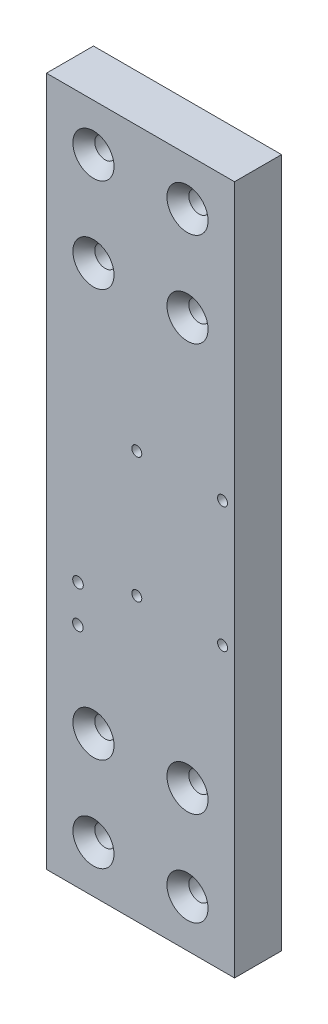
from build123d import *

# Parameters (mm, degrees)
SKETCH1_W                                            = 76.2
SKETCH1_H                                            = 279.4
EXTRUDE1_DEPTH                                       = 19.05
CSK_FOR_5_16_FLAT_HEAD_SOCKET_CAP_SCREW1_D           = 8.4328
CSK_FOR_5_16_FLAT_HEAD_SOCKET_CAP_SCREW1_CSINK_D     = 16.6624
CSK_FOR_5_16_FLAT_HEAD_SOCKET_CAP_SCREW1_CSINK_ANGLE = 82
LPATTERN1_COUNT                                      = 2
LPATTERN1_PITCH                                      = 38.1
LPATTERN1_COUNT_DIR2                                 = 2
LPATTERN1_PITCH_DIR2                                 = 38.1
MIRROR1_COPY_1_D                                     = 8.4328
MIRROR1_COPY_1_CSINK_D                               = 16.6624
MIRROR1_COPY_1_CSINK_ANGLE                           = 82
MIRROR1_COPY_2_D                                     = 8.4328
MIRROR1_COPY_2_CSINK_D                               = 16.6624
MIRROR1_COPY_2_CSINK_ANGLE                           = 82
MIRROR1_COPY_3_D                                     = 8.4328
MIRROR1_COPY_3_CSINK_D                               = 16.6624
MIRROR1_COPY_3_CSINK_ANGLE                           = 82
F_10_32_TAPPED_HOLE1_D                               = 4.0386
F_6_CLEARANCE_HOLE1_D                                = 4.3053


with BuildPart() as part:
    # Sketch1 → Extrude1 (new body)
    with BuildSketch(Plane.XY):
        Rectangle(SKETCH1_W, SKETCH1_H)
    extrude(amount=EXTRUDE1_DEPTH)

    # CSK for 5_16 Flat Head Socket Cap Screw1 (through all)
    with Locations(Plane(origin=(-19.05, -120.65, 19.05), x_dir=(1, 0, 0), z_dir=(0, 0, 1))):
        with Locations((0, 0)):
            csk_for_5_16_flat_head_socket_cap_screw1 = CounterSinkHole(CSK_FOR_5_16_FLAT_HEAD_SOCKET_CAP_SCREW1_D / 2, CSK_FOR_5_16_FLAT_HEAD_SOCKET_CAP_SCREW1_CSINK_D / 2, counter_sink_angle=CSK_FOR_5_16_FLAT_HEAD_SOCKET_CAP_SCREW1_CSINK_ANGLE)

    # LPattern1: CSK for 5_16 Flat Head Socket Cap Screw1 2 × 2
    with Locations(*[(j * LPATTERN1_PITCH_DIR2, i * LPATTERN1_PITCH, 0) for i in range(LPATTERN1_COUNT) for j in range(LPATTERN1_COUNT_DIR2) if (i, j) != (0, 0)]):
        add(csk_for_5_16_flat_head_socket_cap_screw1, mode=Mode.SUBTRACT)

    # Mirror1: CSK for 5_16 Flat Head Socket Cap Screw1 across plane
    add(csk_for_5_16_flat_head_socket_cap_screw1.mirror(Plane.ZX), mode=Mode.SUBTRACT)

    # Mirror1 copy 1 (through all)
    with Locations(Plane(origin=(19.05, 120.65, 19.05), x_dir=(1, 0, 0), z_dir=(0, 0, 1))):
        with Locations((0, 0)):
            CounterSinkHole(MIRROR1_COPY_1_D / 2, MIRROR1_COPY_1_CSINK_D / 2, counter_sink_angle=MIRROR1_COPY_1_CSINK_ANGLE)

    # Mirror1 copy 2 (through all)
    with Locations(Plane(origin=(-19.05, 82.55, 19.05), x_dir=(1, 0, 0), z_dir=(0, 0, 1))):
        with Locations((0, 0)):
            CounterSinkHole(MIRROR1_COPY_2_D / 2, MIRROR1_COPY_2_CSINK_D / 2, counter_sink_angle=MIRROR1_COPY_2_CSINK_ANGLE)

    # Mirror1 copy 3 (through all)
    with Locations(Plane(origin=(19.05, 82.55, 19.05), x_dir=(1, 0, 0), z_dir=(0, 0, 1))):
        with Locations((0, 0)):
            CounterSinkHole(MIRROR1_COPY_3_D / 2, MIRROR1_COPY_3_CSINK_D / 2, counter_sink_angle=MIRROR1_COPY_3_CSINK_ANGLE)

    # 10-32 Tapped Hole1 (through all)
    with Locations(Plane(origin=(-1.4986, 25.4, 0), x_dir=(-1, 0, 0), z_dir=(0, 0, -1))):
        with Locations((0, 0), (-34.7472, 0), (0, -50.8), (-34.7472, -50.8)):
            Hole(F_10_32_TAPPED_HOLE1_D / 2)

    # 6 Clearance Hole1 (through all)
    with Locations(Plane(origin=(-25.320162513, -32.565620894, 19.05), x_dir=(1, 0, 0), z_dir=(0, 0, 1))):
        with Locations((0, 0), (-0.059206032, -15.012064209)):
            Hole(F_6_CLEARANCE_HOLE1_D / 2)


solid = part.part
